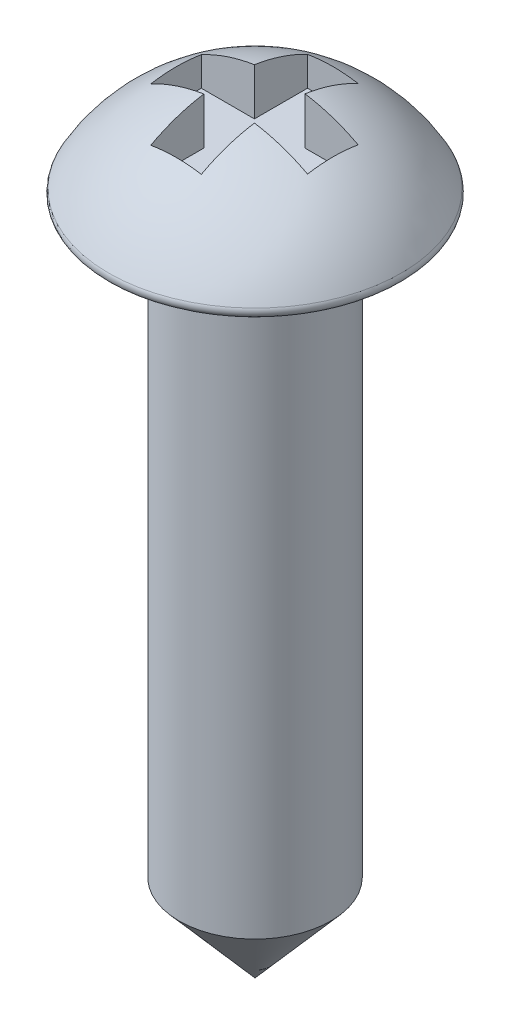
from build123d import *

# Parameters (mm, degrees)
CONG_1_R                = 0.1
ENL_V_MAT_EXTRU_1_DEPTH = 0.5


with BuildPart() as part:
    # Esquisse1 → R_volution1 (revolve)
    with BuildSketch(Plane.XY, mode=Mode.PRIVATE) as r_volution1_sk:
        with BuildLine():
            Line((2.2, 0), (1.1, 0))
            Line((1.1, 0), (1.1, -8.5))
            Line((1.1, -8.5), (0, -9.765529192))
            Line((0, -9.765529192), (0, 1.392961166))
            ThreePointArc((0, 1.392961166), (1.301954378, 1.015441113), (2.2, 0))
        make_face()
    revolve(r_volution1_sk.sketch.rotate(Axis((0, 3.800054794, 0), (0, -1, 0)), 90), axis=Axis((0, 3.800054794, 0), (0, -1, 0)))

    # Cong_1
    cong_1_edges = [part.edges().sort_by_distance(p)[0] for p in [
        (0, 0, -2.2),
    ]]
    fillet(cong_1_edges, radius=CONG_1_R)

    # Esquisse2 → Enl_v. mat.-Extru.1 (cut, symmetric)
    with BuildSketch(Plane(origin=(0, 1.15653742, 0), x_dir=(-1, 0, 0), z_dir=(0, 1, 0))):
        Polygon((-0.361948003, 1.140760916), (0.37159995, 1.140760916), (0.37159995, 0.37038863), (1.141972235, 0.37038863), (1.141972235, -0.363159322), (0.37159995, -0.363159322), (0.37159995, -1.133531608), (-0.361948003, -1.133531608), (-0.361948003, -0.363159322), (-1.132320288, -0.363159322), (-1.132320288, 0.37038863), (-0.361948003, 0.37038863), align=None)
    extrude(amount=ENL_V_MAT_EXTRU_1_DEPTH, both=True, mode=Mode.SUBTRACT)


solid = part.part
